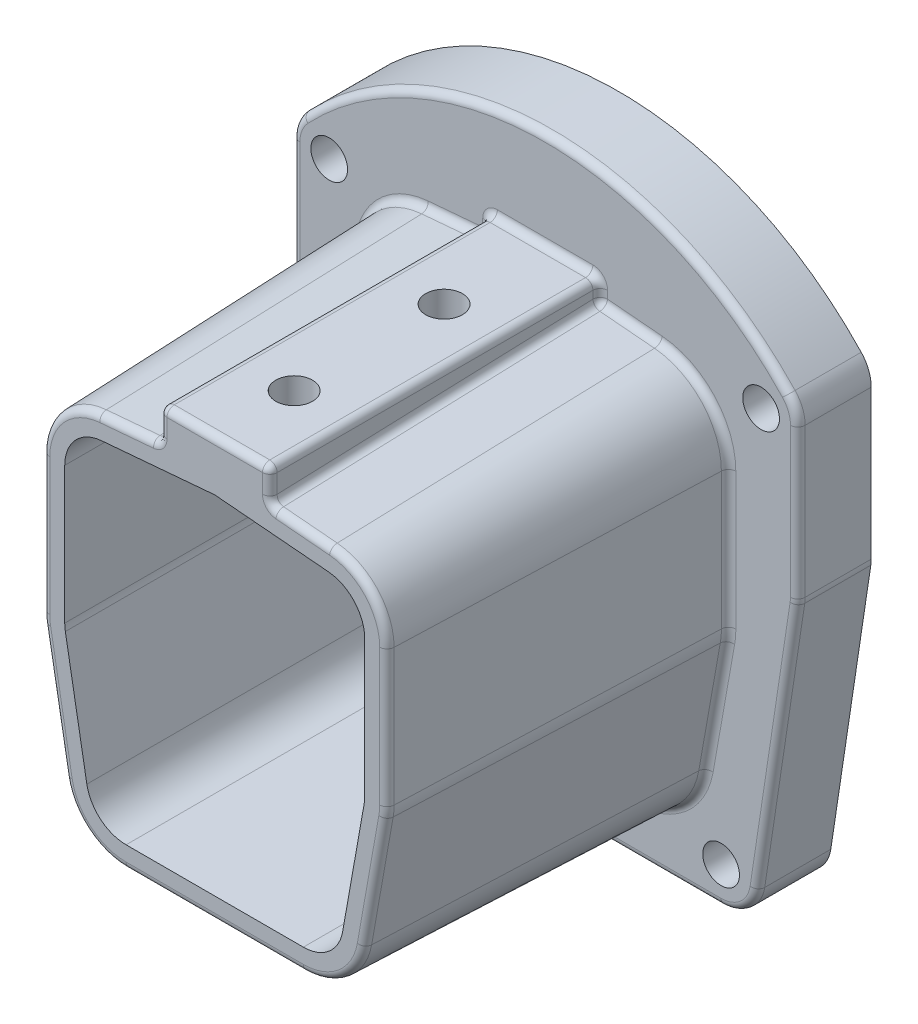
from build123d import *

# Parameters (mm, degrees)
BOSS_EXTRU_1_DEPTH                  = 90
BOSS_EXTRU_1_TAPER                  = 2
BOSS_EXTRU_2_DEPTH                  = 20
ENL_V_MAT_EXTRU_1_DEPTH             = 159.40868325
ESQUISSE4_W                         = 30
ESQUISSE4_H                         = 11.36895812
BOSS_EXTRU_3_DEPTH                  = 90
CONG_1_R                            = 2
DIAM_TRE_DU_PER_AGE_10_0_10_1_D     = 10
DIAM_TRE_DU_PER_AGE_10_0_10_1_DEPTH = 53.75
DIAM_TRE_DU_PER_AGE_10_0_10_1_TIP   = 3.004303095
DIAM_TRE_DU_PER_AGE_10_0_10_2_D     = 10
ENL_V_MAT_EXTRU_2_DEPTH             = 14
CONG_2_R                            = 2


with BuildPart() as part:
    # Esquisse1 → Boss.-Extru.1 (new body)
    with BuildSketch(Plane.XY):
        with BuildLine():
            Line((0, 59.868463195), (-31.710361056, 57.146683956))
            ThreePointArc((-31.710361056, 57.146683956), (-44.734436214, 50.743870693), (-50, 37.219951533))
            Line((-50, 37.219951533), (-50, 0))
            ThreePointArc((-50, 0), (-49.92320712, -1.750947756), (-49.693418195, -3.48844948))
            Line((-49.693418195, -3.48844948), (-43.835538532, -36.558062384))
            ThreePointArc((-43.835538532, -36.558062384), (-36.991848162, -48.395554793), (-24.142120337, -53.069612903))
            Line((-24.142120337, -53.069612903), (24.142120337, -53.069612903))
            ThreePointArc((24.142120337, -53.069612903), (36.991848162, -48.395554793), (43.835538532, -36.558062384))
            Line((43.835538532, -36.558062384), (49.693418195, -3.48844948))
            ThreePointArc((49.693418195, -3.48844948), (49.92320712, -1.750947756), (50, 0))
            Line((50, 0), (50, 37.219951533))
            ThreePointArc((50, 37.219951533), (44.734436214, 50.743870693), (31.710361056, 57.146683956))
            Line((31.710361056, 57.146683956), (0, 59.868463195))
        make_face()
    extrude(amount=BOSS_EXTRU_1_DEPTH, taper=BOSS_EXTRU_1_TAPER)

    # Esquisse3 → Boss.-Extru.2 (add)
    with BuildSketch(Plane(origin=(0, 0, 0), x_dir=(-1, 0, 0), z_dir=(0, 0, -1))):
        with BuildLine():
            Line((-68.814195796, 55.509873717), (-68.814195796, 14.939214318))
            ThreePointArc((-68.814195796, 14.939214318), (-68.786361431, 14.193618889), (-68.703013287, 13.452174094))
            Line((-68.703013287, 13.452174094), (-57.806090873, -59.012359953))
            ThreePointArc((-57.806090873, -59.012359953), (-54.441443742, -65.103921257), (-47.917273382, -67.525319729))
            Line((-47.917273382, -67.525319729), (47.917273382, -67.525319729))
            ThreePointArc((47.917273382, -67.525319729), (54.441443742, -65.103921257), (57.806090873, -59.012359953))
            Line((57.806090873, -59.012359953), (68.703013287, 13.452174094))
            ThreePointArc((68.703013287, 13.452174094), (68.786361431, 14.193618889), (68.814195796, 14.939214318))
            Line((68.814195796, 14.939214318), (68.814195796, 55.509873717))
            ThreePointArc((68.814195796, 55.509873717), (68.107313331, 59.202835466), (66.086602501, 62.373699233))
            ThreePointArc((66.086602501, 62.373699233), (0, 90.873083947), (-66.086602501, 62.373699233))
            ThreePointArc((-66.086602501, 62.373699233), (-68.107313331, 59.202835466), (-68.814195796, 55.509873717))
        make_face()
    extrude(amount=BOSS_EXTRU_2_DEPTH)

    # Esquisse2 → Enl_v. mat.-Extru.1 (cut, through all)
    with BuildSketch(Plane.XY.offset(90)):
        with BuildLine():
            Line((30.92848068, 48.037308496), (0, 50.691976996))
            Line((0, 50.691976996), (-30.92848068, 48.037308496))
            ThreePointArc((-30.92848068, 48.037308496), (-37.998685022, 44.561499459), (-40.857130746, 37.219951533))
            Line((-40.857130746, 37.219951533), (-40.857130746, 0))
            ThreePointArc((-40.857130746, 0), (-40.815443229, -0.950513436), (-40.690700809, -1.893727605))
            Line((-40.690700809, -1.893727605), (-34.832821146, -34.963340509))
            ThreePointArc((-34.832821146, -34.963340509), (-31.117679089, -41.389400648), (-24.142120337, -43.926743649))
            Line((-24.142120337, -43.926743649), (24.142120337, -43.926743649))
            ThreePointArc((24.142120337, -43.926743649), (31.117679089, -41.389400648), (34.832821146, -34.963340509))
            Line((34.832821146, -34.963340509), (40.690700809, -1.893727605))
            ThreePointArc((40.690700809, -1.893727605), (40.815443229, -0.950513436), (40.857130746, 0))
            Line((40.857130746, 0), (40.857130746, 37.219951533))
            ThreePointArc((40.857130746, 37.219951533), (37.998685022, 44.561499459), (30.92848068, 48.037308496))
        make_face()
    extrude(amount=-ENL_V_MAT_EXTRU_1_DEPTH, mode=Mode.SUBTRACT)

    # Esquisse4 → Boss.-Extru.3 (add)
    with BuildSketch(Plane.XY):
        with Locations((0, 58.756197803)):
            Rectangle(ESQUISSE4_W, ESQUISSE4_H)
    extrude(amount=BOSS_EXTRU_3_DEPTH)

    # Cong_1
    cong_1_edges = [part.edges().sort_by_distance(p)[0] for p in [
        (-42.419015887, 48.618675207, 90),
        (44.734436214, 50.743870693, 0),
        (50, 18.609975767, 0),
        (49.92320712, -1.750947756, 0),
        (46.764478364, -20.023255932, 0),
        (-46.857130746, 18.609975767, 90),
        (-23.355180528, 57.863829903, 0),
        (36.991848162, -48.395554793, 0),
        (15, 61.510826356, 0),
        (-23.220794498, 54.720939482, 90),
        (0, -53.069612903, 0),
        (15, 59.933613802, 90),
        (0, 64.440676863, 90),
        (-15, 59.933613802, 90),
        (-15, 61.510826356, 0),
        (-15, 57.003763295, 45),
        (-15, 64.440676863, 45),
        (15, 57.003763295, 45),
        (15, 64.440676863, 45),
        (0, 64.440676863, 0),
        (-36.991848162, -48.395554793, 0),
        (-46.764478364, -20.023255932, 0),
        (-49.92320712, -1.750947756, 0),
        (-50, 18.609975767, 0),
        (-44.734436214, 50.743870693, 0),
        (-46.792405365, -1.475797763, 90),
        (23.355180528, 57.863829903, 0),
        (-43.669786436, -19.475068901, 90),
        (-34.972597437, -45.987183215, 90),
        (0, -49.926743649, 90),
        (34.972597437, -45.987183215, 90),
        (43.669786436, -19.475068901, 90),
        (46.792405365, -1.475797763, 90),
        (46.857130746, 18.609975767, 90),
        (23.220794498, 54.720939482, 90),
        (42.419015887, 48.618675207, 90),
        (54.441443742, -65.103921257, 0),
        (0, -67.525319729, 0),
        (-54.441443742, -65.103921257, 0),
        (-63.25455208, -22.780092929, 0),
        (-68.786361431, 14.193618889, 0),
        (-68.814195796, 35.224544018, 0),
        (-68.107313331, 59.202835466, 0),
        (0, 90.873083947, 0),
        (68.107313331, 59.202835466, 0),
        (68.814195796, 35.224544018, 0),
        (68.786361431, 14.193618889, 0),
        (63.25455208, -22.780092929, 0),
    ]]
    fillet(cong_1_edges, radius=CONG_1_R)

    # Diam_tre du per_age _10.0 _10_1
    with Locations(Plane(origin=(0, 64.440676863, 0), x_dir=(-1, 0, 0), z_dir=(0, 1, 0))):
        with Locations((0, 27.543057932), (0, 68.373320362)):
            Hole(DIAM_TRE_DU_PER_AGE_10_0_10_1_D / 2, depth=DIAM_TRE_DU_PER_AGE_10_0_10_1_DEPTH)
            with Locations((0, 0, -(DIAM_TRE_DU_PER_AGE_10_0_10_1_DEPTH + DIAM_TRE_DU_PER_AGE_10_0_10_1_TIP / 2))):  # 118° drill point
                Cone(0, DIAM_TRE_DU_PER_AGE_10_0_10_1_D / 2, DIAM_TRE_DU_PER_AGE_10_0_10_1_TIP, mode=Mode.SUBTRACT)

    # Diam_tre du per_age _10.0 _10_2 (through all)
    with Locations(Plane.XY):
        with Locations((-47.917273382, -57.525319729), (-58.814195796, 55.509873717)):
            diam_tre_du_per_age_10_0_10_2 = Hole(DIAM_TRE_DU_PER_AGE_10_0_10_2_D / 2)

    # Sym_trie1: Diam_tre du per_age _10.0 _10_2 across plane
    add(diam_tre_du_per_age_10_0_10_2.mirror(Plane(origin=(0, 0, 0), x_dir=(0, 0, 1), z_dir=(1, 0, 0))), mode=Mode.SUBTRACT)

    # Esquisse9 → Enl_v. mat.-Extru.2 (cut)
    with BuildSketch(Plane(origin=(0, 0, -20), x_dir=(-1, 0, 0), z_dir=(0, 0, -1))):
        with BuildLine():
            Line((-15, -50.978963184), (15, -50.978963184))
            ThreePointArc((15, -50.978963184), (21, -56.978963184), (15, -62.978963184))
            Line((15, -62.978963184), (-15, -62.978963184))
            ThreePointArc((-15, -62.978963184), (-21, -56.978963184), (-15, -50.978963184))
        make_face()
        with BuildLine():
            Line((-47.341198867, -4.109213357), (-41.870003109, -33.606094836))
            ThreePointArc((-41.870003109, -33.606094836), (-46.675140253, -40.599710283), (-53.6687557, -35.794573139))
            Line((-53.6687557, -35.794573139), (-59.139951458, -6.29769166))
            ThreePointArc((-59.139951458, -6.29769166), (-54.334814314, 0.695923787), (-47.341198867, -4.109213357))
        make_face()
        with BuildLine():
            Line((-50.038121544, 43.513603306), (-50.038121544, 13.513603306))
            ThreePointArc((-50.038121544, 13.513603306), (-56.038121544, 7.513603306), (-62.038121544, 13.513603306))
            Line((-62.038121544, 13.513603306), (-62.038121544, 43.513603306))
            ThreePointArc((-62.038121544, 43.513603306), (-56.038121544, 49.513603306), (-50.038121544, 43.513603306))
        make_face()
        with BuildLine():
            Line((-43.374352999, 69.757952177), (-14.538860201, 78.035292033))
            ThreePointArc((-14.538860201, 78.035292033), (-7.11629367, 73.923661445), (-11.227924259, 66.501094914))
            Line((-11.227924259, 66.501094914), (-40.063417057, 58.223755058))
            ThreePointArc((-40.063417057, 58.223755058), (-47.485983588, 62.335385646), (-43.374352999, 69.757952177))
        make_face()
        with BuildLine():
            Line((47.341198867, -4.109213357), (41.870003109, -33.606094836))
            ThreePointArc((41.870003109, -33.606094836), (46.675140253, -40.599710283), (53.6687557, -35.794573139))
            Line((53.6687557, -35.794573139), (59.139951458, -6.29769166))
            ThreePointArc((59.139951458, -6.29769166), (54.334814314, 0.695923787), (47.341198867, -4.109213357))
        make_face()
        with BuildLine():
            Line((50.038121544, 43.513603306), (50.038121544, 13.513603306))
            ThreePointArc((50.038121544, 13.513603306), (56.038121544, 7.513603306), (62.038121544, 13.513603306))
            Line((62.038121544, 13.513603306), (62.038121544, 43.513603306))
            ThreePointArc((62.038121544, 43.513603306), (56.038121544, 49.513603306), (50.038121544, 43.513603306))
        make_face()
        with BuildLine():
            Line((43.374352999, 69.757952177), (14.538860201, 78.035292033))
            ThreePointArc((14.538860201, 78.035292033), (7.11629367, 73.923661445), (11.227924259, 66.501094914))
            Line((11.227924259, 66.501094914), (40.063417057, 58.223755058))
            ThreePointArc((40.063417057, 58.223755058), (47.485983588, 62.335385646), (43.374352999, 69.757952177))
        make_face()
    extrude(amount=-ENL_V_MAT_EXTRU_2_DEPTH, mode=Mode.SUBTRACT)

    # Cong_2
    cong_2_edges = [part.edges().sort_by_distance(p)[0] for p in [
        (21, -56.978963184, -6),
        (0, -50.978963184, -6),
        (-21, -56.978963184, -6),
        (0, -62.978963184, -6),
        (54.334814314, 0.695923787, -6),
        (44.605600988, -18.857654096, -6),
        (46.675140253, -40.599710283, -6),
        (56.404353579, -21.046132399, -6),
        (56.038121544, 49.513603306, -6),
        (50.038121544, 28.513603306, -6),
        (56.038121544, 7.513603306, -6),
        (62.038121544, 28.513603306, -6),
        (47.485983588, 62.335385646, -6),
        (28.9566066, 73.896622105, -6),
        (7.11629367, 73.923661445, -6),
        (25.645670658, 62.362424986, -6),
        (-54.334814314, 0.695923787, -6),
        (-56.404353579, -21.046132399, -6),
        (-46.675140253, -40.599710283, -6),
        (-44.605600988, -18.857654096, -6),
        (-56.038121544, 49.513603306, -6),
        (-62.038121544, 28.513603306, -6),
        (-56.038121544, 7.513603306, -6),
        (-50.038121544, 28.513603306, -6),
        (-47.485983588, 62.335385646, -6),
        (-25.645670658, 62.362424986, -6),
        (-7.11629367, 73.923661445, -6),
        (-28.9566066, 73.896622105, -6),
    ]]
    fillet(cong_2_edges, radius=CONG_2_R)


solid = part.part
